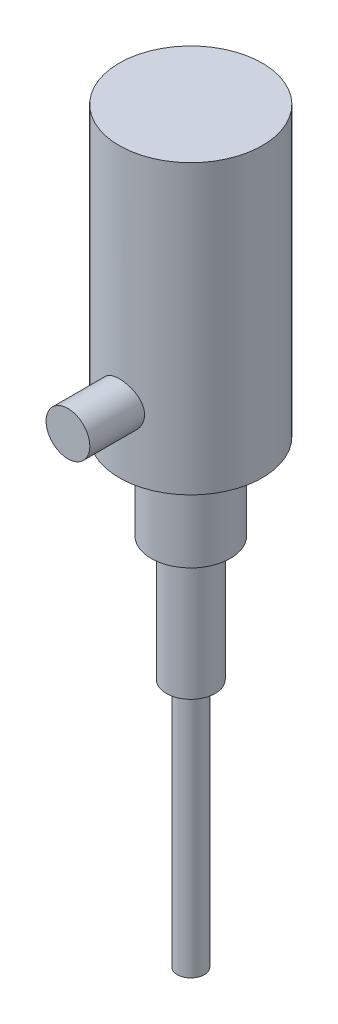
from build123d import *

# Parameters (mm, degrees)
BOSS_EXTRUDE1_REACH      = 462.741
BOSS_EXTRUDE1_END_RADIUS = 42.5
SKETCH2_R                = 13


with BuildPart() as part:
    # Sketch1 → Revolve1 (revolve)
    with BuildSketch(Plane.XY):
        Polygon((0, 0), (-8, 0), (-8, 148), (-14.5, 148), (-14.5, 222), (-23.5, 222), (-23.5, 273), (-42.5, 273), (-42.5, 444), (0, 444), align=None)
    revolve(axis=Axis((0, 444, 0), (0, -1, 0)))

    # Boss-Extrude1: up to this cylinder (the profile starts outside it)
    boss_extrude1_end = Plane(origin=(0, 311, 0), z_dir=(0, 1, 0)) * Cylinder(BOSS_EXTRUDE1_END_RADIUS, 1011.482, mode=Mode.PRIVATE)
    # Sketch2 → Boss-Extrude1 (add, up to the surface)
    with BuildSketch(Plane.XY.offset(73), mode=Mode.PRIVATE) as boss_extrude1_sk1:
        with Locations((0, 311)):
            Circle(SKETCH2_R)
    boss_extrude1_tool1 = extrude(boss_extrude1_sk1.sketch, amount=-BOSS_EXTRUDE1_REACH, mode=Mode.PRIVATE) - boss_extrude1_end
    add(boss_extrude1_tool1.solids().sort_by_distance((0, 311, 73))[0])


solid = part.part
